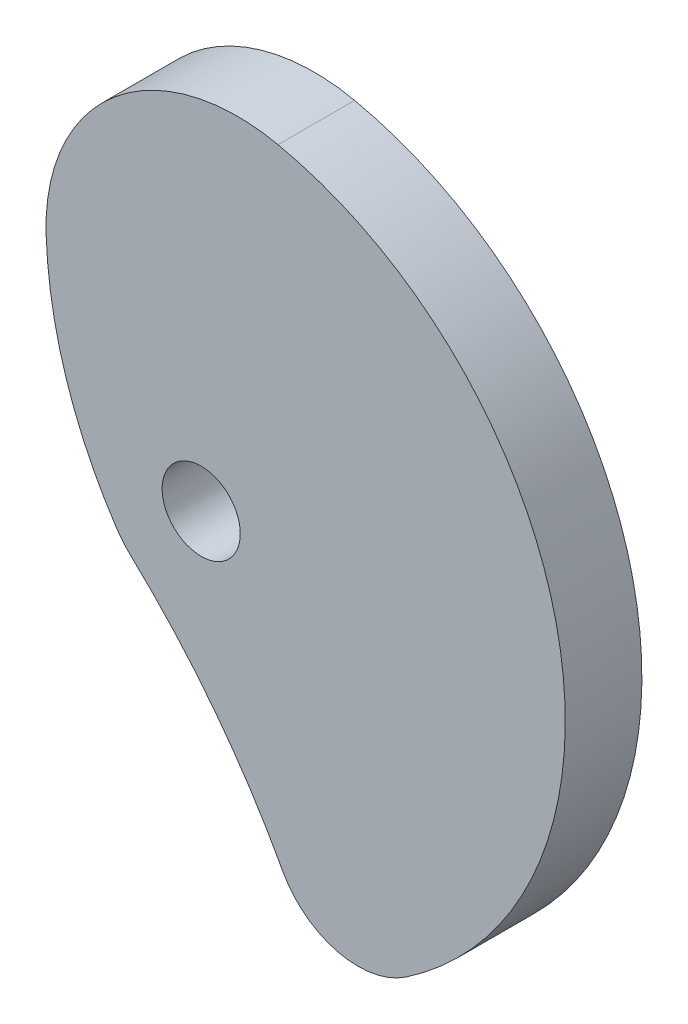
from build123d import *

# Parameters (mm, degrees)
ESQUISSE1_R      = 10.197305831
EXTRUSION1_DEPTH = 20


with BuildPart() as part:
    # Esquisse1 → Extrusion1 (new body)
    with BuildSketch(Plane.XY):
        with BuildLine():
            ThreePointArc((53.528670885, -78.507845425), (93.257371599, 18.217108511), (20.049235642, 92.880722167))
            ThreePointArc((20.049235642, 92.880722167), (-22.579138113, 82.357917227), (-40.465641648, 42.258283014))
            ThreePointArc((-40.465641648, 42.258283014), (-35.268135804, 12.49636756), (-22.165189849, -14.726756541))
            ThreePointArc((-22.165189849, -14.726756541), (-20.315495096, -17.188765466), (-18.193763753, -19.420606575))
            ThreePointArc((-18.193763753, -19.420606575), (3.601523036, -43.431021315), (21.242749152, -70.639874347))
            ThreePointArc((21.242749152, -70.639874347), (35.634885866, -81.758300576), (53.528670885, -78.507845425))
        make_face()
        Circle(ESQUISSE1_R, mode=Mode.SUBTRACT)
    extrude(amount=EXTRUSION1_DEPTH)


solid = part.part
